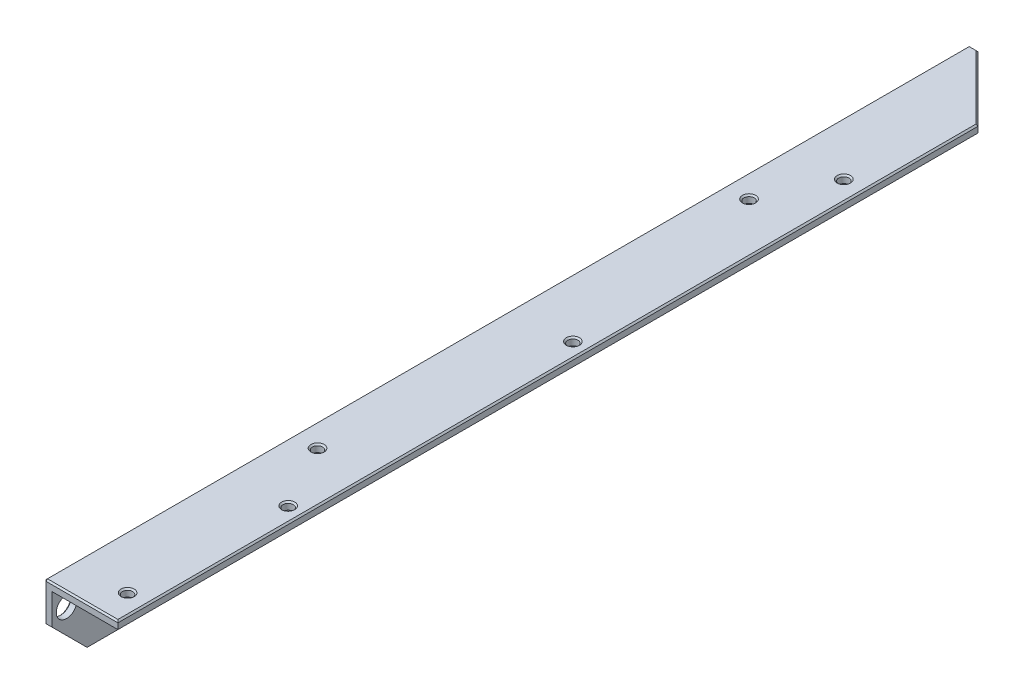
ISO-10303-21;
HEADER;
FILE_DESCRIPTION(('STEP AP214'),'2;1');
FILE_NAME('part.step','',(''),(''),'','','');
FILE_SCHEMA(('AUTOMOTIVE_DESIGN { 1 0 10303 214 1 1 1 1 }'));
ENDSEC;
DATA;
#1=APPLICATION_CONTEXT('core data for automotive mechanical design processes');
#2=APPLICATION_PROTOCOL_DEFINITION('international standard','automotive_design',2000,#1);
#3=PRODUCT_CONTEXT('',#1,'mechanical');
#4=PRODUCT('Part','Part','',(#3));
#5=PRODUCT_RELATED_PRODUCT_CATEGORY('part','',(#4));
#6=PRODUCT_DEFINITION_FORMATION('','',#4);
#7=PRODUCT_DEFINITION_CONTEXT('part definition',#1,'design');
#8=PRODUCT_DEFINITION('design','',#6,#7);
#9=PRODUCT_DEFINITION_SHAPE('','',#8);
#10=(LENGTH_UNIT() NAMED_UNIT(*) SI_UNIT(.MILLI.,.METRE.));
#11=(NAMED_UNIT(*) PLANE_ANGLE_UNIT() SI_UNIT($,.RADIAN.));
#12=(NAMED_UNIT(*) SI_UNIT($,.STERADIAN.) SOLID_ANGLE_UNIT());
#13=UNCERTAINTY_MEASURE_WITH_UNIT(LENGTH_MEASURE(1.E-05),#10,'distance_accuracy_value','');
#14=(GEOMETRIC_REPRESENTATION_CONTEXT(3) GLOBAL_UNCERTAINTY_ASSIGNED_CONTEXT((#13)) GLOBAL_UNIT_ASSIGNED_CONTEXT((#10,
#11,#12)) REPRESENTATION_CONTEXT('',''));
#15=CARTESIAN_POINT('',(0.,0.,0.));
#16=DIRECTION('',(0.,0.,1.));
#17=DIRECTION('',(1.,0.,0.));
#18=AXIS2_PLACEMENT_3D('',#15,#16,#17);
#19=CARTESIAN_POINT('',(2.5,0.,315.));
#20=DIRECTION('',(0.,-1.,0.));
#21=DIRECTION('',(1.,0.,0.));
#22=AXIS2_PLACEMENT_3D('',#19,#20,#21);
#23=PLANE('',#22);
#24=DIRECTION('',(-1.,0.,0.));
#25=VECTOR('',#24,1.);
#26=CARTESIAN_POINT('',(3.,0.,255.));
#27=LINE('',#26,#25);
#28=CARTESIAN_POINT('',(2.5,0.,255.));
#29=VERTEX_POINT('',#28);
#30=CARTESIAN_POINT('',(0.500000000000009,0.,255.));
#31=VERTEX_POINT('',#30);
#32=EDGE_CURVE('E212',#29,#31,#27,.T.);
#33=ORIENTED_EDGE('',*,*,#32,.T.);
#34=DIRECTION('',(0.,0.,-1.));
#35=VECTOR('',#34,1.);
#36=CARTESIAN_POINT('',(0.500000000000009,0.,315.));
#37=LINE('',#36,#35);
#38=CARTESIAN_POINT('',(0.500000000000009,0.,0.));
#39=VERTEX_POINT('',#38);
#40=EDGE_CURVE('E382',#31,#39,#37,.T.);
#41=ORIENTED_EDGE('',*,*,#40,.T.);
#42=DIRECTION('',(-1.,0.,0.));
#43=VECTOR('',#42,1.);
#44=CARTESIAN_POINT('',(2.5,0.,0.));
#45=LINE('',#44,#43);
#46=CARTESIAN_POINT('',(2.5,0.,0.));
#47=VERTEX_POINT('',#46);
#48=EDGE_CURVE('E258',#47,#39,#45,.T.);
#49=ORIENTED_EDGE('',*,*,#48,.F.);
#50=DIRECTION('',(0.,0.,-1.));
#51=VECTOR('',#50,1.);
#52=CARTESIAN_POINT('',(2.5,0.,315.));
#53=LINE('',#52,#51);
#54=EDGE_CURVE('E280',#29,#47,#53,.T.);
#55=ORIENTED_EDGE('',*,*,#54,.F.);
#56=EDGE_LOOP('',(#33,#41,#49,#55));
#57=FACE_BOUND('',#56,.T.);
#58=ADVANCED_FACE('F34',(#57),#23,.T.);
#59=DIRECTION('',(-1.,0.,0.));
#60=VECTOR('',#59,1.);
#61=CARTESIAN_POINT('',(3.,0.,303.));
#62=LINE('',#61,#60);
#63=CARTESIAN_POINT('',(2.5,0.,303.));
#64=VERTEX_POINT('',#63);
#65=CARTESIAN_POINT('',(0.500000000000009,0.,303.));
#66=VERTEX_POINT('',#65);
#67=EDGE_CURVE('E227',#64,#66,#62,.T.);
#68=ORIENTED_EDGE('',*,*,#67,.T.);
#69=DIRECTION('',(0.,0.,-1.));
#70=VECTOR('',#69,1.);
#71=CARTESIAN_POINT('',(0.500000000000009,0.,315.));
#72=LINE('',#71,#70);
#73=CARTESIAN_POINT('',(0.500000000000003,0.,275.));
#74=VERTEX_POINT('',#73);
#75=EDGE_CURVE('E373',#66,#74,#72,.T.);
#76=ORIENTED_EDGE('',*,*,#75,.T.);
#77=DIRECTION('',(-1.,0.,0.));
#78=VECTOR('',#77,1.);
#79=CARTESIAN_POINT('',(3.,0.,275.));
#80=LINE('',#79,#78);
#81=CARTESIAN_POINT('',(2.5,0.,275.));
#82=VERTEX_POINT('',#81);
#83=EDGE_CURVE('E205',#82,#74,#80,.T.);
#84=ORIENTED_EDGE('',*,*,#83,.F.);
#85=EDGE_CURVE('E211',#64,#82,#53,.T.);
#86=ORIENTED_EDGE('',*,*,#85,.F.);
#87=EDGE_LOOP('',(#68,#76,#84,#86));
#88=FACE_BOUND('',#87,.T.);
#89=ADVANCED_FACE('F406',(#88),#23,.T.);
#90=CARTESIAN_POINT('',(2.5,22.5,315.));
#91=DIRECTION('',(1.,0.,0.));
#92=DIRECTION('',(0.,1.,0.));
#93=AXIS2_PLACEMENT_3D('',#90,#91,#92);
#94=PLANE('',#93);
#95=CARTESIAN_POINT('',(2.5,15.5,5.));
#96=DIRECTION('',(1.,0.,0.));
#97=DIRECTION('',(0.,1.,0.));
#98=AXIS2_PLACEMENT_3D('',#95,#96,#97);
#99=CIRCLE('',#98,3.5);
#100=CARTESIAN_POINT('',(2.5,19.,5.));
#101=VERTEX_POINT('',#100);
#102=EDGE_CURVE('E653',#101,#101,#99,.T.);
#103=ORIENTED_EDGE('',*,*,#102,.F.);
#104=EDGE_LOOP('',(#103));
#105=FACE_BOUND('',#104,.T.);
#106=CARTESIAN_POINT('',(2.5,15.5,310.));
#107=DIRECTION('',(1.,0.,0.));
#108=DIRECTION('',(0.,1.,0.));
#109=AXIS2_PLACEMENT_3D('',#106,#107,#108);
#110=CIRCLE('',#109,3.50000000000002);
#111=CARTESIAN_POINT('',(2.5,19.,310.));
#112=VERTEX_POINT('',#111);
#113=EDGE_CURVE('E656',#112,#112,#110,.T.);
#114=ORIENTED_EDGE('',*,*,#113,.F.);
#115=EDGE_LOOP('',(#114));
#116=FACE_BOUND('',#115,.T.);
#117=CARTESIAN_POINT('',(2.5,13.5,257.5));
#118=DIRECTION('',(1.,0.,0.));
#119=DIRECTION('',(0.,1.,0.));
#120=AXIS2_PLACEMENT_3D('',#117,#118,#119);
#121=CIRCLE('',#120,2.5);
#122=CARTESIAN_POINT('',(2.5,16.,257.5));
#123=VERTEX_POINT('',#122);
#124=CARTESIAN_POINT('',(2.5,13.5,255.));
#125=VERTEX_POINT('',#124);
#126=EDGE_CURVE('E219',#123,#125,#121,.F.);
#127=ORIENTED_EDGE('',*,*,#126,.T.);
#128=DIRECTION('',(0.,-1.,0.));
#129=VECTOR('',#128,1.);
#130=CARTESIAN_POINT('',(2.5,22.5,255.));
#131=LINE('',#130,#129);
#132=EDGE_CURVE('E221',#125,#29,#131,.T.);
#133=ORIENTED_EDGE('',*,*,#132,.T.);
#134=ORIENTED_EDGE('',*,*,#54,.T.);
#135=DIRECTION('',(0.,-1.,0.));
#136=VECTOR('',#135,1.);
#137=CARTESIAN_POINT('',(2.5,22.5,0.));
#138=LINE('',#137,#136);
#139=CARTESIAN_POINT('',(2.5,22.5,0.));
#140=VERTEX_POINT('',#139);
#141=EDGE_CURVE('E263',#140,#47,#138,.T.);
#142=ORIENTED_EDGE('',*,*,#141,.F.);
#143=DIRECTION('',(0.,0.,-1.));
#144=VECTOR('',#143,1.);
#145=CARTESIAN_POINT('',(2.5,22.5,315.));
#146=LINE('',#145,#144);
#147=CARTESIAN_POINT('',(2.5,22.5,315.));
#148=VERTEX_POINT('',#147);
#149=EDGE_CURVE('E277',#148,#140,#146,.T.);
#150=ORIENTED_EDGE('',*,*,#149,.F.);
#151=DIRECTION('',(0.,-1.,0.));
#152=VECTOR('',#151,1.);
#153=CARTESIAN_POINT('',(2.5,22.5,315.));
#154=LINE('',#153,#152);
#155=CARTESIAN_POINT('',(2.5,11.9999999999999,315.));
#156=VERTEX_POINT('',#155);
#157=EDGE_CURVE('E271',#148,#156,#154,.T.);
#158=ORIENTED_EDGE('',*,*,#157,.T.);
#159=DIRECTION('',(0.,0.707106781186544,0.707106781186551));
#160=VECTOR('',#159,1.);
#161=CARTESIAN_POINT('',(2.5,17.2499999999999,320.25));
#162=LINE('',#161,#160);
#163=EDGE_CURVE('E230',#64,#156,#162,.T.);
#164=ORIENTED_EDGE('',*,*,#163,.F.);
#165=ORIENTED_EDGE('',*,*,#85,.T.);
#166=DIRECTION('',(0.,1.,0.));
#167=VECTOR('',#166,1.);
#168=CARTESIAN_POINT('',(2.5,22.5,275.));
#169=LINE('',#168,#167);
#170=CARTESIAN_POINT('',(2.5,13.5,275.));
#171=VERTEX_POINT('',#170);
#172=EDGE_CURVE('E197',#82,#171,#169,.T.);
#173=ORIENTED_EDGE('',*,*,#172,.T.);
#174=CARTESIAN_POINT('',(2.5,13.5,272.5));
#175=DIRECTION('',(1.,0.,0.));
#176=DIRECTION('',(0.,1.,0.));
#177=AXIS2_PLACEMENT_3D('',#174,#175,#176);
#178=CIRCLE('',#177,2.5);
#179=CARTESIAN_POINT('',(2.5,16.,272.5));
#180=VERTEX_POINT('',#179);
#181=EDGE_CURVE('E186',#171,#180,#178,.F.);
#182=ORIENTED_EDGE('',*,*,#181,.T.);
#183=DIRECTION('',(0.,0.,-1.));
#184=VECTOR('',#183,1.);
#185=CARTESIAN_POINT('',(2.5,16.,315.));
#186=LINE('',#185,#184);
#187=EDGE_CURVE('E196',#180,#123,#186,.T.);
#188=ORIENTED_EDGE('',*,*,#187,.T.);
#189=EDGE_LOOP('',(#127,#133,#134,#142,#150,#158,#164,#165,#173,#182,#188));
#190=FACE_BOUND('',#189,.T.);
#191=ADVANCED_FACE('F36',(#105,#116,#190),#94,.T.);
#192=CARTESIAN_POINT('',(0.,0.,315.));
#193=DIRECTION('',(-1.,0.,0.));
#194=DIRECTION('',(0.,0.,1.));
#195=AXIS2_PLACEMENT_3D('',#192,#193,#194);
#196=PLANE('',#195);
#197=DIRECTION('',(0.,0.,-1.));
#198=VECTOR('',#197,1.);
#199=CARTESIAN_POINT('',(0.,24.5,315.));
#200=LINE('',#199,#198);
#201=CARTESIAN_POINT('',(0.,24.5,314.5));
#202=VERTEX_POINT('',#201);
#203=CARTESIAN_POINT('',(0.,24.5,0.5));
#204=VERTEX_POINT('',#203);
#205=EDGE_CURVE('E366',#202,#204,#200,.T.);
#206=ORIENTED_EDGE('',*,*,#205,.T.);
#207=DIRECTION('',(0.,-1.,0.));
#208=VECTOR('',#207,1.);
#209=CARTESIAN_POINT('',(0.,0.,0.5));
#210=LINE('',#209,#208);
#211=CARTESIAN_POINT('',(0.,0.500000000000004,0.5));
#212=VERTEX_POINT('',#211);
#213=EDGE_CURVE('E368',#204,#212,#210,.T.);
#214=ORIENTED_EDGE('',*,*,#213,.T.);
#215=DIRECTION('',(0.,0.,1.));
#216=VECTOR('',#215,1.);
#217=CARTESIAN_POINT('',(0.,0.500000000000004,315.));
#218=LINE('',#217,#216);
#219=CARTESIAN_POINT('',(0.,0.500000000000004,254.5));
#220=VERTEX_POINT('',#219);
#221=EDGE_CURVE('E348',#212,#220,#218,.T.);
#222=ORIENTED_EDGE('',*,*,#221,.T.);
#223=DIRECTION('',(0.,1.,0.));
#224=VECTOR('',#223,1.);
#225=CARTESIAN_POINT('',(0.,0.,254.5));
#226=LINE('',#225,#224);
#227=CARTESIAN_POINT('',(0.,13.5,254.5));
#228=VERTEX_POINT('',#227);
#229=EDGE_CURVE('E350',#220,#228,#226,.T.);
#230=ORIENTED_EDGE('',*,*,#229,.T.);
#231=CARTESIAN_POINT('',(0.,13.5,257.5));
#232=DIRECTION('',(-1.,0.,0.));
#233=DIRECTION('',(0.,0.,1.));
#234=AXIS2_PLACEMENT_3D('',#231,#232,#233);
#235=CIRCLE('',#234,3.);
#236=CARTESIAN_POINT('',(0.,16.5,257.5));
#237=VERTEX_POINT('',#236);
#238=EDGE_CURVE('E352',#228,#237,#235,.F.);
#239=ORIENTED_EDGE('',*,*,#238,.T.);
#240=DIRECTION('',(0.,0.,1.));
#241=VECTOR('',#240,1.);
#242=CARTESIAN_POINT('',(0.,16.5,315.));
#243=LINE('',#242,#241);
#244=CARTESIAN_POINT('',(0.,16.5,272.5));
#245=VERTEX_POINT('',#244);
#246=EDGE_CURVE('E354',#237,#245,#243,.T.);
#247=ORIENTED_EDGE('',*,*,#246,.T.);
#248=CARTESIAN_POINT('',(0.,13.5,272.5));
#249=DIRECTION('',(-1.,0.,0.));
#250=DIRECTION('',(0.,0.,1.));
#251=AXIS2_PLACEMENT_3D('',#248,#249,#250);
#252=CIRCLE('',#251,3.);
#253=CARTESIAN_POINT('',(0.,13.5,275.5));
#254=VERTEX_POINT('',#253);
#255=EDGE_CURVE('E356',#245,#254,#252,.F.);
#256=ORIENTED_EDGE('',*,*,#255,.T.);
#257=DIRECTION('',(0.,-1.,0.));
#258=VECTOR('',#257,1.);
#259=CARTESIAN_POINT('',(0.,0.,275.5));
#260=LINE('',#259,#258);
#261=CARTESIAN_POINT('',(0.,0.500000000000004,275.5));
#262=VERTEX_POINT('',#261);
#263=EDGE_CURVE('E358',#254,#262,#260,.T.);
#264=ORIENTED_EDGE('',*,*,#263,.T.);
#265=DIRECTION('',(0.,0.,1.));
#266=VECTOR('',#265,1.);
#267=CARTESIAN_POINT('',(0.,0.500000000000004,315.));
#268=LINE('',#267,#266);
#269=CARTESIAN_POINT('',(0.,0.500000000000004,302.792893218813));
#270=VERTEX_POINT('',#269);
#271=EDGE_CURVE('E360',#262,#270,#268,.T.);
#272=ORIENTED_EDGE('',*,*,#271,.T.);
#273=DIRECTION('',(0.,0.707106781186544,0.707106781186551));
#274=VECTOR('',#273,1.);
#275=CARTESIAN_POINT('',(0.,12.3535533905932,314.646446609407));
#276=LINE('',#275,#274);
#277=CARTESIAN_POINT('',(0.,12.2071067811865,314.5));
#278=VERTEX_POINT('',#277);
#279=EDGE_CURVE('E362',#270,#278,#276,.T.);
#280=ORIENTED_EDGE('',*,*,#279,.T.);
#281=DIRECTION('',(0.,1.,0.));
#282=VECTOR('',#281,1.);
#283=CARTESIAN_POINT('',(0.,25.,314.5));
#284=LINE('',#283,#282);
#285=EDGE_CURVE('E364',#278,#202,#284,.T.);
#286=ORIENTED_EDGE('',*,*,#285,.T.);
#287=EDGE_LOOP('',(#206,#214,#222,#230,#239,#247,#256,#264,#272,#280,#286));
#288=FACE_BOUND('',#287,.T.);
#289=CARTESIAN_POINT('',(0.,15.5,310.));
#290=DIRECTION('',(-1.,0.,0.));
#291=DIRECTION('',(0.,0.,1.));
#292=AXIS2_PLACEMENT_3D('',#289,#290,#291);
#293=CIRCLE('',#292,4.);
#294=CARTESIAN_POINT('',(0.,15.5,314.));
#295=VERTEX_POINT('',#294);
#296=EDGE_CURVE('E345',#295,#295,#293,.F.);
#297=ORIENTED_EDGE('',*,*,#296,.T.);
#298=EDGE_LOOP('',(#297));
#299=FACE_BOUND('',#298,.T.);
#300=CARTESIAN_POINT('',(0.,15.5,5.));
#301=DIRECTION('',(-1.,0.,0.));
#302=DIRECTION('',(0.,0.,1.));
#303=AXIS2_PLACEMENT_3D('',#300,#301,#302);
#304=CIRCLE('',#303,4.);
#305=CARTESIAN_POINT('',(0.,15.5,9.00000000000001));
#306=VERTEX_POINT('',#305);
#307=EDGE_CURVE('E342',#306,#306,#304,.F.);
#308=ORIENTED_EDGE('',*,*,#307,.T.);
#309=EDGE_LOOP('',(#308));
#310=FACE_BOUND('',#309,.T.);
#311=ADVANCED_FACE('F417',(#288,#299,#310),#196,.T.);
#312=CARTESIAN_POINT('',(25.,22.5,315.));
#313=DIRECTION('',(0.,-1.,0.));
#314=DIRECTION('',(1.,0.,0.));
#315=AXIS2_PLACEMENT_3D('',#312,#313,#314);
#316=PLANE('',#315);
#317=DIRECTION('',(-0.707106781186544,0.,-0.707106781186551));
#318=VECTOR('',#317,1.);
#319=CARTESIAN_POINT('',(171.5,22.5,168.500000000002));
#320=LINE('',#319,#318);
#321=CARTESIAN_POINT('',(25.,22.5,22.));
#322=VERTEX_POINT('',#321);
#323=CARTESIAN_POINT('',(3.00000000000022,22.5,0.));
#324=VERTEX_POINT('',#323);
#325=EDGE_CURVE('E238',#322,#324,#320,.T.);
#326=ORIENTED_EDGE('',*,*,#325,.F.);
#327=DIRECTION('',(0.,0.,-1.));
#328=VECTOR('',#327,1.);
#329=CARTESIAN_POINT('',(25.,22.5,315.));
#330=LINE('',#329,#328);
#331=CARTESIAN_POINT('',(25.,22.5,315.));
#332=VERTEX_POINT('',#331);
#333=EDGE_CURVE('E274',#332,#322,#330,.T.);
#334=ORIENTED_EDGE('',*,*,#333,.F.);
#335=DIRECTION('',(-1.,0.,0.));
#336=VECTOR('',#335,1.);
#337=CARTESIAN_POINT('',(25.,22.5,315.));
#338=LINE('',#337,#336);
#339=EDGE_CURVE('E268',#332,#148,#338,.T.);
#340=ORIENTED_EDGE('',*,*,#339,.T.);
#341=ORIENTED_EDGE('',*,*,#149,.T.);
#342=DIRECTION('',(-1.,0.,0.));
#343=VECTOR('',#342,1.);
#344=CARTESIAN_POINT('',(25.,22.5,0.));
#345=LINE('',#344,#343);
#346=EDGE_CURVE('E261',#324,#140,#345,.T.);
#347=ORIENTED_EDGE('',*,*,#346,.F.);
#348=EDGE_LOOP('',(#326,#334,#340,#341,#347));
#349=FACE_BOUND('',#348,.T.);
#350=CARTESIAN_POINT('',(18.3,22.5,305.));
#351=DIRECTION('',(0.,-1.,0.));
#352=DIRECTION('',(1.,0.,0.));
#353=AXIS2_PLACEMENT_3D('',#350,#351,#352);
#354=CIRCLE('',#353,1.75);
#355=CARTESIAN_POINT('',(20.05,22.5,305.));
#356=VERTEX_POINT('',#355);
#357=EDGE_CURVE('E240',#356,#356,#354,.T.);
#358=ORIENTED_EDGE('',*,*,#357,.F.);
#359=EDGE_LOOP('',(#358));
#360=FACE_BOUND('',#359,.T.);
#361=CARTESIAN_POINT('',(20.,22.5,252.));
#362=DIRECTION('',(0.,-1.,0.));
#363=DIRECTION('',(1.,0.,0.));
#364=AXIS2_PLACEMENT_3D('',#361,#362,#363);
#365=CIRCLE('',#364,1.75);
#366=CARTESIAN_POINT('',(21.75,22.5,252.));
#367=VERTEX_POINT('',#366);
#368=EDGE_CURVE('E243',#367,#367,#365,.T.);
#369=ORIENTED_EDGE('',*,*,#368,.F.);
#370=EDGE_LOOP('',(#369));
#371=FACE_BOUND('',#370,.T.);
#372=CARTESIAN_POINT('',(8.,22.5,230.));
#373=DIRECTION('',(0.,-1.,0.));
#374=DIRECTION('',(1.,0.,0.));
#375=AXIS2_PLACEMENT_3D('',#372,#373,#374);
#376=CIRCLE('',#375,1.75);
#377=CARTESIAN_POINT('',(9.75,22.5,230.));
#378=VERTEX_POINT('',#377);
#379=EDGE_CURVE('E246',#378,#378,#376,.T.);
#380=ORIENTED_EDGE('',*,*,#379,.F.);
#381=EDGE_LOOP('',(#380));
#382=FACE_BOUND('',#381,.T.);
#383=CARTESIAN_POINT('',(20.,22.5,155.));
#384=DIRECTION('',(0.,-1.,0.));
#385=DIRECTION('',(1.,0.,0.));
#386=AXIS2_PLACEMENT_3D('',#383,#384,#385);
#387=CIRCLE('',#386,1.75);
#388=CARTESIAN_POINT('',(21.75,22.5,155.));
#389=VERTEX_POINT('',#388);
#390=EDGE_CURVE('E249',#389,#389,#387,.T.);
#391=ORIENTED_EDGE('',*,*,#390,.F.);
#392=EDGE_LOOP('',(#391));
#393=FACE_BOUND('',#392,.T.);
#394=CARTESIAN_POINT('',(8.,22.5,83.));
#395=DIRECTION('',(0.,-1.,0.));
#396=DIRECTION('',(1.,0.,0.));
#397=AXIS2_PLACEMENT_3D('',#394,#395,#396);
#398=CIRCLE('',#397,1.75);
#399=CARTESIAN_POINT('',(9.75,22.5,83.));
#400=VERTEX_POINT('',#399);
#401=EDGE_CURVE('E252',#400,#400,#398,.T.);
#402=ORIENTED_EDGE('',*,*,#401,.F.);
#403=EDGE_LOOP('',(#402));
#404=FACE_BOUND('',#403,.T.);
#405=CARTESIAN_POINT('',(18.3,22.5,61.));
#406=DIRECTION('',(0.,-1.,0.));
#407=DIRECTION('',(1.,0.,0.));
#408=AXIS2_PLACEMENT_3D('',#405,#406,#407);
#409=CIRCLE('',#408,1.75);
#410=CARTESIAN_POINT('',(20.05,22.5,61.));
#411=VERTEX_POINT('',#410);
#412=EDGE_CURVE('E255',#411,#411,#409,.T.);
#413=ORIENTED_EDGE('',*,*,#412,.F.);
#414=EDGE_LOOP('',(#413));
#415=FACE_BOUND('',#414,.T.);
#416=ADVANCED_FACE('F420',(#349,#360,#371,#382,#393,#404,#415),#316,.T.);
#417=CARTESIAN_POINT('',(25.,25.,315.));
#418=DIRECTION('',(1.,0.,0.));
#419=DIRECTION('',(0.,1.,0.));
#420=AXIS2_PLACEMENT_3D('',#417,#418,#419);
#421=PLANE('',#420);
#422=DIRECTION('',(0.,1.,0.));
#423=VECTOR('',#422,1.);
#424=CARTESIAN_POINT('',(25.,22.,22.));
#425=LINE('',#424,#423);
#426=CARTESIAN_POINT('',(25.,24.5,22.));
#427=VERTEX_POINT('',#426);
#428=EDGE_CURVE('E235',#322,#427,#425,.T.);
#429=ORIENTED_EDGE('',*,*,#428,.T.);
#430=DIRECTION('',(0.,0.,1.));
#431=VECTOR('',#430,1.);
#432=CARTESIAN_POINT('',(25.,24.5,315.));
#433=LINE('',#432,#431);
#434=CARTESIAN_POINT('',(25.,24.5,315.));
#435=VERTEX_POINT('',#434);
#436=EDGE_CURVE('E329',#427,#435,#433,.T.);
#437=ORIENTED_EDGE('',*,*,#436,.T.);
#438=DIRECTION('',(0.,-1.,0.));
#439=VECTOR('',#438,1.);
#440=CARTESIAN_POINT('',(25.,25.,315.));
#441=LINE('',#440,#439);
#442=EDGE_CURVE('E266',#435,#332,#441,.T.);
#443=ORIENTED_EDGE('',*,*,#442,.T.);
#444=ORIENTED_EDGE('',*,*,#333,.T.);
#445=EDGE_LOOP('',(#429,#437,#443,#444));
#446=FACE_BOUND('',#445,.T.);
#447=ADVANCED_FACE('F425',(#446),#421,.T.);
#448=CARTESIAN_POINT('',(0.,25.,315.));
#449=DIRECTION('',(0.,1.,0.));
#450=DIRECTION('',(0.,0.,1.));
#451=AXIS2_PLACEMENT_3D('',#448,#449,#450);
#452=PLANE('',#451);
#453=CARTESIAN_POINT('',(18.3,25.,61.));
#454=DIRECTION('',(0.,1.,0.));
#455=DIRECTION('',(0.,0.,1.));
#456=AXIS2_PLACEMENT_3D('',#453,#454,#455);
#457=CIRCLE('',#456,2.25);
#458=CARTESIAN_POINT('',(18.3,25.,63.25));
#459=VERTEX_POINT('',#458);
#460=EDGE_CURVE('E311',#459,#459,#457,.F.);
#461=ORIENTED_EDGE('',*,*,#460,.T.);
#462=EDGE_LOOP('',(#461));
#463=FACE_BOUND('',#462,.T.);
#464=CARTESIAN_POINT('',(8.,25.,83.));
#465=DIRECTION('',(0.,1.,0.));
#466=DIRECTION('',(0.,0.,1.));
#467=AXIS2_PLACEMENT_3D('',#464,#465,#466);
#468=CIRCLE('',#467,2.25);
#469=CARTESIAN_POINT('',(8.,25.,85.25));
#470=VERTEX_POINT('',#469);
#471=EDGE_CURVE('E308',#470,#470,#468,.F.);
#472=ORIENTED_EDGE('',*,*,#471,.T.);
#473=EDGE_LOOP('',(#472));
#474=FACE_BOUND('',#473,.T.);
#475=CARTESIAN_POINT('',(20.,25.,155.));
#476=DIRECTION('',(0.,1.,0.));
#477=DIRECTION('',(0.,0.,1.));
#478=AXIS2_PLACEMENT_3D('',#475,#476,#477);
#479=CIRCLE('',#478,2.25);
#480=CARTESIAN_POINT('',(20.,25.,157.25));
#481=VERTEX_POINT('',#480);
#482=EDGE_CURVE('E305',#481,#481,#479,.F.);
#483=ORIENTED_EDGE('',*,*,#482,.T.);
#484=EDGE_LOOP('',(#483));
#485=FACE_BOUND('',#484,.T.);
#486=CARTESIAN_POINT('',(8.,25.,230.));
#487=DIRECTION('',(0.,1.,0.));
#488=DIRECTION('',(0.,0.,1.));
#489=AXIS2_PLACEMENT_3D('',#486,#487,#488);
#490=CIRCLE('',#489,2.25);
#491=CARTESIAN_POINT('',(8.,25.,232.25));
#492=VERTEX_POINT('',#491);
#493=EDGE_CURVE('E302',#492,#492,#490,.F.);
#494=ORIENTED_EDGE('',*,*,#493,.T.);
#495=EDGE_LOOP('',(#494));
#496=FACE_BOUND('',#495,.T.);
#497=CARTESIAN_POINT('',(20.,25.,252.));
#498=DIRECTION('',(0.,1.,0.));
#499=DIRECTION('',(0.,0.,1.));
#500=AXIS2_PLACEMENT_3D('',#497,#498,#499);
#501=CIRCLE('',#500,2.25000000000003);
#502=CARTESIAN_POINT('',(20.,25.,254.25));
#503=VERTEX_POINT('',#502);
#504=EDGE_CURVE('E299',#503,#503,#501,.F.);
#505=ORIENTED_EDGE('',*,*,#504,.T.);
#506=EDGE_LOOP('',(#505));
#507=FACE_BOUND('',#506,.T.);
#508=CARTESIAN_POINT('',(18.3,25.,305.));
#509=DIRECTION('',(0.,1.,0.));
#510=DIRECTION('',(0.,0.,1.));
#511=AXIS2_PLACEMENT_3D('',#508,#509,#510);
#512=CIRCLE('',#511,2.25000000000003);
#513=CARTESIAN_POINT('',(18.3,25.,307.25));
#514=VERTEX_POINT('',#513);
#515=EDGE_CURVE('E296',#514,#514,#512,.F.);
#516=ORIENTED_EDGE('',*,*,#515,.T.);
#517=EDGE_LOOP('',(#516));
#518=FACE_BOUND('',#517,.T.);
#519=DIRECTION('',(0.,0.,-1.));
#520=VECTOR('',#519,1.);
#521=CARTESIAN_POINT('',(24.5,25.,315.));
#522=LINE('',#521,#520);
#523=CARTESIAN_POINT('',(24.5,25.,314.5));
#524=VERTEX_POINT('',#523);
#525=CARTESIAN_POINT('',(24.5,25.,22.2071067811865));
#526=VERTEX_POINT('',#525);
#527=EDGE_CURVE('E291',#524,#526,#522,.T.);
#528=ORIENTED_EDGE('',*,*,#527,.T.);
#529=DIRECTION('',(-0.707106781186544,0.,-0.707106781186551));
#530=VECTOR('',#529,1.);
#531=CARTESIAN_POINT('',(2.64644660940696,25.,0.353553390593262));
#532=LINE('',#531,#530);
#533=CARTESIAN_POINT('',(2.7928932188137,25.,0.5));
#534=VERTEX_POINT('',#533);
#535=EDGE_CURVE('E294',#526,#534,#532,.T.);
#536=ORIENTED_EDGE('',*,*,#535,.T.);
#537=DIRECTION('',(-1.,0.,0.));
#538=VECTOR('',#537,1.);
#539=CARTESIAN_POINT('',(0.,25.,0.5));
#540=LINE('',#539,#538);
#541=CARTESIAN_POINT('',(0.500000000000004,25.,0.5));
#542=VERTEX_POINT('',#541);
#543=EDGE_CURVE('E287',#534,#542,#540,.T.);
#544=ORIENTED_EDGE('',*,*,#543,.T.);
#545=DIRECTION('',(0.,0.,1.));
#546=VECTOR('',#545,1.);
#547=CARTESIAN_POINT('',(0.500000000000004,25.,315.));
#548=LINE('',#547,#546);
#549=CARTESIAN_POINT('',(0.500000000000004,25.,314.5));
#550=VERTEX_POINT('',#549);
#551=EDGE_CURVE('E285',#542,#550,#548,.T.);
#552=ORIENTED_EDGE('',*,*,#551,.T.);
#553=DIRECTION('',(1.,0.,0.));
#554=VECTOR('',#553,1.);
#555=CARTESIAN_POINT('',(25.,25.,314.5));
#556=LINE('',#555,#554);
#557=EDGE_CURVE('E289',#550,#524,#556,.T.);
#558=ORIENTED_EDGE('',*,*,#557,.T.);
#559=EDGE_LOOP('',(#528,#536,#544,#552,#558));
#560=FACE_BOUND('',#559,.T.);
#561=ADVANCED_FACE('F422',(#463,#474,#485,#496,#507,#518,#560),#452,.T.);
#562=CARTESIAN_POINT('',(0.,0.,315.));
#563=DIRECTION('',(0.,0.,-1.));
#564=DIRECTION('',(-1.,0.,0.));
#565=AXIS2_PLACEMENT_3D('',#562,#563,#564);
#566=PLANE('',#565);
#567=ORIENTED_EDGE('',*,*,#442,.F.);
#568=DIRECTION('',(-1.,0.,0.));
#569=VECTOR('',#568,1.);
#570=CARTESIAN_POINT('',(0.,24.5,315.));
#571=LINE('',#570,#569);
#572=CARTESIAN_POINT('',(0.500000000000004,24.5,315.));
#573=VERTEX_POINT('',#572);
#574=EDGE_CURVE('E334',#435,#573,#571,.T.);
#575=ORIENTED_EDGE('',*,*,#574,.T.);
#576=DIRECTION('',(0.,-1.,0.));
#577=VECTOR('',#576,1.);
#578=CARTESIAN_POINT('',(0.500000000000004,11.9999999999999,315.));
#579=LINE('',#578,#577);
#580=CARTESIAN_POINT('',(0.500000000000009,11.9999999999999,315.));
#581=VERTEX_POINT('',#580);
#582=EDGE_CURVE('E332',#573,#581,#579,.T.);
#583=ORIENTED_EDGE('',*,*,#582,.T.);
#584=DIRECTION('',(-1.,0.,0.));
#585=VECTOR('',#584,1.);
#586=CARTESIAN_POINT('',(3.,11.9999999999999,315.));
#587=LINE('',#586,#585);
#588=EDGE_CURVE('E224',#156,#581,#587,.T.);
#589=ORIENTED_EDGE('',*,*,#588,.F.);
#590=ORIENTED_EDGE('',*,*,#157,.F.);
#591=ORIENTED_EDGE('',*,*,#339,.F.);
#592=EDGE_LOOP('',(#567,#575,#583,#589,#590,#591));
#593=FACE_BOUND('',#592,.T.);
#594=ADVANCED_FACE('F415',(#593),#566,.F.);
#595=CARTESIAN_POINT('',(0.,0.,0.));
#596=DIRECTION('',(0.,0.,-1.));
#597=DIRECTION('',(-1.,0.,0.));
#598=AXIS2_PLACEMENT_3D('',#595,#596,#597);
#599=PLANE('',#598);
#600=DIRECTION('',(0.,1.,0.));
#601=VECTOR('',#600,1.);
#602=CARTESIAN_POINT('',(0.500000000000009,0.,0.));
#603=LINE('',#602,#601);
#604=CARTESIAN_POINT('',(0.500000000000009,24.5,0.));
#605=VERTEX_POINT('',#604);
#606=EDGE_CURVE('E336',#39,#605,#603,.T.);
#607=ORIENTED_EDGE('',*,*,#606,.T.);
#608=DIRECTION('',(1.,0.,0.));
#609=VECTOR('',#608,1.);
#610=CARTESIAN_POINT('',(0.,24.5,0.));
#611=LINE('',#610,#609);
#612=CARTESIAN_POINT('',(3.00000000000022,24.5,0.));
#613=VERTEX_POINT('',#612);
#614=EDGE_CURVE('E338',#605,#613,#611,.T.);
#615=ORIENTED_EDGE('',*,*,#614,.T.);
#616=DIRECTION('',(0.,1.,0.));
#617=VECTOR('',#616,1.);
#618=CARTESIAN_POINT('',(3.00000000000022,22.,0.));
#619=LINE('',#618,#617);
#620=EDGE_CURVE('E232',#324,#613,#619,.T.);
#621=ORIENTED_EDGE('',*,*,#620,.F.);
#622=ORIENTED_EDGE('',*,*,#346,.T.);
#623=ORIENTED_EDGE('',*,*,#141,.T.);
#624=ORIENTED_EDGE('',*,*,#48,.T.);
#625=EDGE_LOOP('',(#607,#615,#621,#622,#623,#624));
#626=FACE_BOUND('',#625,.T.);
#627=ADVANCED_FACE('F452',(#626),#599,.T.);
#628=CARTESIAN_POINT('',(18.3,22.,61.));
#629=DIRECTION('',(0.,1.,0.));
#630=DIRECTION('',(0.,0.,1.));
#631=AXIS2_PLACEMENT_3D('',#628,#629,#630);
#632=CYLINDRICAL_SURFACE('',#631,1.75);
#633=CARTESIAN_POINT('',(18.3,24.5,61.));
#634=DIRECTION('',(0.,1.,0.));
#635=DIRECTION('',(0.,0.,1.));
#636=AXIS2_PLACEMENT_3D('',#633,#634,#635);
#637=CIRCLE('',#636,1.75);
#638=CARTESIAN_POINT('',(18.3,24.5,62.75));
#639=VERTEX_POINT('',#638);
#640=EDGE_CURVE('E282',#639,#639,#637,.T.);
#641=ORIENTED_EDGE('',*,*,#640,.T.);
#642=EDGE_LOOP('',(#641));
#643=FACE_BOUND('',#642,.T.);
#644=ORIENTED_EDGE('',*,*,#412,.T.);
#645=EDGE_LOOP('',(#644));
#646=FACE_BOUND('',#645,.T.);
#647=ADVANCED_FACE('F449',(#643,#646),#632,.F.);
#648=CARTESIAN_POINT('',(8.,22.,83.));
#649=DIRECTION('',(0.,1.,0.));
#650=DIRECTION('',(0.,0.,1.));
#651=AXIS2_PLACEMENT_3D('',#648,#649,#650);
#652=CYLINDRICAL_SURFACE('',#651,1.75);
#653=CARTESIAN_POINT('',(8.,24.5,83.));
#654=DIRECTION('',(0.,1.,0.));
#655=DIRECTION('',(0.,0.,1.));
#656=AXIS2_PLACEMENT_3D('',#653,#654,#655);
#657=CIRCLE('',#656,1.75);
#658=CARTESIAN_POINT('',(8.,24.5,84.75));
#659=VERTEX_POINT('',#658);
#660=EDGE_CURVE('E314',#659,#659,#657,.T.);
#661=ORIENTED_EDGE('',*,*,#660,.T.);
#662=EDGE_LOOP('',(#661));
#663=FACE_BOUND('',#662,.T.);
#664=ORIENTED_EDGE('',*,*,#401,.T.);
#665=EDGE_LOOP('',(#664));
#666=FACE_BOUND('',#665,.T.);
#667=ADVANCED_FACE('F451',(#663,#666),#652,.F.);
#668=CARTESIAN_POINT('',(20.,22.,155.));
#669=DIRECTION('',(0.,1.,0.));
#670=DIRECTION('',(0.,0.,1.));
#671=AXIS2_PLACEMENT_3D('',#668,#669,#670);
#672=CYLINDRICAL_SURFACE('',#671,1.75);
#673=CARTESIAN_POINT('',(20.,24.5,155.));
#674=DIRECTION('',(0.,1.,0.));
#675=DIRECTION('',(0.,0.,1.));
#676=AXIS2_PLACEMENT_3D('',#673,#674,#675);
#677=CIRCLE('',#676,1.75);
#678=CARTESIAN_POINT('',(20.,24.5,156.75));
#679=VERTEX_POINT('',#678);
#680=EDGE_CURVE('E317',#679,#679,#677,.T.);
#681=ORIENTED_EDGE('',*,*,#680,.T.);
#682=EDGE_LOOP('',(#681));
#683=FACE_BOUND('',#682,.T.);
#684=ORIENTED_EDGE('',*,*,#390,.T.);
#685=EDGE_LOOP('',(#684));
#686=FACE_BOUND('',#685,.T.);
#687=ADVANCED_FACE('F459',(#683,#686),#672,.F.);
#688=CARTESIAN_POINT('',(8.,22.,230.));
#689=DIRECTION('',(0.,1.,0.));
#690=DIRECTION('',(0.,0.,1.));
#691=AXIS2_PLACEMENT_3D('',#688,#689,#690);
#692=CYLINDRICAL_SURFACE('',#691,1.75);
#693=CARTESIAN_POINT('',(8.,24.5,230.));
#694=DIRECTION('',(0.,1.,0.));
#695=DIRECTION('',(0.,0.,1.));
#696=AXIS2_PLACEMENT_3D('',#693,#694,#695);
#697=CIRCLE('',#696,1.75);
#698=CARTESIAN_POINT('',(8.,24.5,231.75));
#699=VERTEX_POINT('',#698);
#700=EDGE_CURVE('E320',#699,#699,#697,.T.);
#701=ORIENTED_EDGE('',*,*,#700,.T.);
#702=EDGE_LOOP('',(#701));
#703=FACE_BOUND('',#702,.T.);
#704=ORIENTED_EDGE('',*,*,#379,.T.);
#705=EDGE_LOOP('',(#704));
#706=FACE_BOUND('',#705,.T.);
#707=ADVANCED_FACE('F466',(#703,#706),#692,.F.);
#708=CARTESIAN_POINT('',(20.,22.,252.));
#709=DIRECTION('',(0.,1.,0.));
#710=DIRECTION('',(0.,0.,1.));
#711=AXIS2_PLACEMENT_3D('',#708,#709,#710);
#712=CYLINDRICAL_SURFACE('',#711,1.75);
#713=CARTESIAN_POINT('',(20.,24.5,252.));
#714=DIRECTION('',(0.,1.,0.));
#715=DIRECTION('',(0.,0.,1.));
#716=AXIS2_PLACEMENT_3D('',#713,#714,#715);
#717=CIRCLE('',#716,1.75);
#718=CARTESIAN_POINT('',(20.,24.5,253.75));
#719=VERTEX_POINT('',#718);
#720=EDGE_CURVE('E323',#719,#719,#717,.T.);
#721=ORIENTED_EDGE('',*,*,#720,.T.);
#722=EDGE_LOOP('',(#721));
#723=FACE_BOUND('',#722,.T.);
#724=ORIENTED_EDGE('',*,*,#368,.T.);
#725=EDGE_LOOP('',(#724));
#726=FACE_BOUND('',#725,.T.);
#727=ADVANCED_FACE('F470',(#723,#726),#712,.F.);
#728=CARTESIAN_POINT('',(18.3,22.,305.));
#729=DIRECTION('',(0.,1.,0.));
#730=DIRECTION('',(0.,0.,1.));
#731=AXIS2_PLACEMENT_3D('',#728,#729,#730);
#732=CYLINDRICAL_SURFACE('',#731,1.75);
#733=CARTESIAN_POINT('',(18.3,24.5,305.));
#734=DIRECTION('',(0.,1.,0.));
#735=DIRECTION('',(0.,0.,1.));
#736=AXIS2_PLACEMENT_3D('',#733,#734,#735);
#737=CIRCLE('',#736,1.75);
#738=CARTESIAN_POINT('',(18.3,24.5,306.75));
#739=VERTEX_POINT('',#738);
#740=EDGE_CURVE('E326',#739,#739,#737,.T.);
#741=ORIENTED_EDGE('',*,*,#740,.T.);
#742=EDGE_LOOP('',(#741));
#743=FACE_BOUND('',#742,.T.);
#744=ORIENTED_EDGE('',*,*,#357,.T.);
#745=EDGE_LOOP('',(#744));
#746=FACE_BOUND('',#745,.T.);
#747=ADVANCED_FACE('F474',(#743,#746),#732,.F.);
#748=CARTESIAN_POINT('',(3.00000000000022,22.,0.));
#749=DIRECTION('',(-0.707106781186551,0.,0.707106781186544));
#750=DIRECTION('',(0.707106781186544,0.,0.707106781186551));
#751=AXIS2_PLACEMENT_3D('',#748,#749,#750);
#752=PLANE('',#751);
#753=ORIENTED_EDGE('',*,*,#620,.T.);
#754=DIRECTION('',(0.707106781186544,0.,0.707106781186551));
#755=VECTOR('',#754,1.);
#756=CARTESIAN_POINT('',(25.,24.5,22.));
#757=LINE('',#756,#755);
#758=EDGE_CURVE('E340',#613,#427,#757,.T.);
#759=ORIENTED_EDGE('',*,*,#758,.T.);
#760=ORIENTED_EDGE('',*,*,#428,.F.);
#761=ORIENTED_EDGE('',*,*,#325,.T.);
#762=EDGE_LOOP('',(#753,#759,#760,#761));
#763=FACE_BOUND('',#762,.T.);
#764=ADVANCED_FACE('F478',(#763),#752,.F.);
#765=CARTESIAN_POINT('',(3.,11.9999999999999,315.));
#766=DIRECTION('',(0.,0.707106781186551,-0.707106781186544));
#767=DIRECTION('',(0.,0.707106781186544,0.707106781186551));
#768=AXIS2_PLACEMENT_3D('',#765,#766,#767);
#769=PLANE('',#768);
#770=ORIENTED_EDGE('',*,*,#588,.T.);
#771=DIRECTION('',(0.,-0.707106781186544,-0.707106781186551));
#772=VECTOR('',#771,1.);
#773=CARTESIAN_POINT('',(0.50000000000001,0.,303.));
#774=LINE('',#773,#772);
#775=EDGE_CURVE('E371',#581,#66,#774,.T.);
#776=ORIENTED_EDGE('',*,*,#775,.T.);
#777=ORIENTED_EDGE('',*,*,#67,.F.);
#778=ORIENTED_EDGE('',*,*,#163,.T.);
#779=EDGE_LOOP('',(#770,#776,#777,#778));
#780=FACE_BOUND('',#779,.T.);
#781=ADVANCED_FACE('F482',(#780),#769,.F.);
#782=CARTESIAN_POINT('',(3.,0.,255.));
#783=DIRECTION('',(0.,0.,1.));
#784=DIRECTION('',(1.,0.,0.));
#785=AXIS2_PLACEMENT_3D('',#782,#783,#784);
#786=PLANE('',#785);
#787=DIRECTION('',(-1.,0.,0.));
#788=VECTOR('',#787,1.);
#789=CARTESIAN_POINT('',(3.,13.5,255.));
#790=LINE('',#789,#788);
#791=CARTESIAN_POINT('',(0.500000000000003,13.5,255.));
#792=VERTEX_POINT('',#791);
#793=EDGE_CURVE('E214',#125,#792,#790,.T.);
#794=ORIENTED_EDGE('',*,*,#793,.T.);
#795=DIRECTION('',(0.,-1.,0.));
#796=VECTOR('',#795,1.);
#797=CARTESIAN_POINT('',(0.500000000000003,0.,255.));
#798=LINE('',#797,#796);
#799=EDGE_CURVE('E49',#792,#31,#798,.T.);
#800=ORIENTED_EDGE('',*,*,#799,.T.);
#801=ORIENTED_EDGE('',*,*,#32,.F.);
#802=ORIENTED_EDGE('',*,*,#132,.F.);
#803=EDGE_LOOP('',(#794,#800,#801,#802));
#804=FACE_BOUND('',#803,.T.);
#805=ADVANCED_FACE('F486',(#804),#786,.T.);
#806=CARTESIAN_POINT('',(3.,13.5,257.5));
#807=DIRECTION('',(-1.,0.,0.));
#808=DIRECTION('',(0.,0.,1.));
#809=AXIS2_PLACEMENT_3D('',#806,#807,#808);
#810=CYLINDRICAL_SURFACE('',#809,2.5);
#811=DIRECTION('',(-1.,0.,0.));
#812=VECTOR('',#811,1.);
#813=CARTESIAN_POINT('',(3.,16.,257.5));
#814=LINE('',#813,#812);
#815=CARTESIAN_POINT('',(0.500000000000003,16.,257.5));
#816=VERTEX_POINT('',#815);
#817=EDGE_CURVE('E661',#123,#816,#814,.T.);
#818=ORIENTED_EDGE('',*,*,#817,.T.);
#819=CARTESIAN_POINT('',(0.500000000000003,13.5,257.5));
#820=DIRECTION('',(-1.,0.,0.));
#821=DIRECTION('',(0.,0.,1.));
#822=AXIS2_PLACEMENT_3D('',#819,#820,#821);
#823=CIRCLE('',#822,2.5);
#824=EDGE_CURVE('E57',#816,#792,#823,.T.);
#825=ORIENTED_EDGE('',*,*,#824,.T.);
#826=ORIENTED_EDGE('',*,*,#793,.F.);
#827=ORIENTED_EDGE('',*,*,#126,.F.);
#828=EDGE_LOOP('',(#818,#825,#826,#827));
#829=FACE_BOUND('',#828,.T.);
#830=ADVANCED_FACE('F490',(#829),#810,.F.);
#831=CARTESIAN_POINT('',(3.,16.,257.5));
#832=DIRECTION('',(0.,-1.,0.));
#833=DIRECTION('',(0.,0.,-1.));
#834=AXIS2_PLACEMENT_3D('',#831,#832,#833);
#835=PLANE('',#834);
#836=DIRECTION('',(-1.,0.,0.));
#837=VECTOR('',#836,1.);
#838=CARTESIAN_POINT('',(3.,16.,272.5));
#839=LINE('',#838,#837);
#840=CARTESIAN_POINT('',(0.500000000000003,16.,272.5));
#841=VERTEX_POINT('',#840);
#842=EDGE_CURVE('E192',#180,#841,#839,.T.);
#843=ORIENTED_EDGE('',*,*,#842,.T.);
#844=DIRECTION('',(0.,0.,-1.));
#845=VECTOR('',#844,1.);
#846=CARTESIAN_POINT('',(0.500000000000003,16.,257.5));
#847=LINE('',#846,#845);
#848=EDGE_CURVE('E378',#841,#816,#847,.T.);
#849=ORIENTED_EDGE('',*,*,#848,.T.);
#850=ORIENTED_EDGE('',*,*,#817,.F.);
#851=ORIENTED_EDGE('',*,*,#187,.F.);
#852=EDGE_LOOP('',(#843,#849,#850,#851));
#853=FACE_BOUND('',#852,.T.);
#854=ADVANCED_FACE('F493',(#853),#835,.T.);
#855=CARTESIAN_POINT('',(3.,13.5,272.5));
#856=DIRECTION('',(-1.,0.,0.));
#857=DIRECTION('',(0.,0.,1.));
#858=AXIS2_PLACEMENT_3D('',#855,#856,#857);
#859=CYLINDRICAL_SURFACE('',#858,2.5);
#860=DIRECTION('',(-1.,0.,0.));
#861=VECTOR('',#860,1.);
#862=CARTESIAN_POINT('',(3.,13.5,275.));
#863=LINE('',#862,#861);
#864=CARTESIAN_POINT('',(0.500000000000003,13.5,275.));
#865=VERTEX_POINT('',#864);
#866=EDGE_CURVE('E189',#171,#865,#863,.T.);
#867=ORIENTED_EDGE('',*,*,#866,.T.);
#868=CARTESIAN_POINT('',(0.500000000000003,13.5,272.5));
#869=DIRECTION('',(-1.,0.,0.));
#870=DIRECTION('',(0.,0.,1.));
#871=AXIS2_PLACEMENT_3D('',#868,#869,#870);
#872=CIRCLE('',#871,2.5);
#873=EDGE_CURVE('E376',#865,#841,#872,.T.);
#874=ORIENTED_EDGE('',*,*,#873,.T.);
#875=ORIENTED_EDGE('',*,*,#842,.F.);
#876=ORIENTED_EDGE('',*,*,#181,.F.);
#877=EDGE_LOOP('',(#867,#874,#875,#876));
#878=FACE_BOUND('',#877,.T.);
#879=ADVANCED_FACE('F188',(#878),#859,.F.);
#880=CARTESIAN_POINT('',(3.,13.5,275.));
#881=DIRECTION('',(0.,0.,-1.));
#882=DIRECTION('',(-1.,0.,0.));
#883=AXIS2_PLACEMENT_3D('',#880,#881,#882);
#884=PLANE('',#883);
#885=ORIENTED_EDGE('',*,*,#83,.T.);
#886=DIRECTION('',(0.,1.,0.));
#887=VECTOR('',#886,1.);
#888=CARTESIAN_POINT('',(0.500000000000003,13.5,275.));
#889=LINE('',#888,#887);
#890=EDGE_CURVE('E204',#74,#865,#889,.T.);
#891=ORIENTED_EDGE('',*,*,#890,.T.);
#892=ORIENTED_EDGE('',*,*,#866,.F.);
#893=ORIENTED_EDGE('',*,*,#172,.F.);
#894=EDGE_LOOP('',(#885,#891,#892,#893));
#895=FACE_BOUND('',#894,.T.);
#896=ADVANCED_FACE('F201',(#895),#884,.T.);
#897=CARTESIAN_POINT('',(3.,15.5,310.));
#898=DIRECTION('',(-1.,0.,0.));
#899=DIRECTION('',(0.,0.,1.));
#900=AXIS2_PLACEMENT_3D('',#897,#898,#899);
#901=CYLINDRICAL_SURFACE('',#900,3.50000000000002);
#902=CARTESIAN_POINT('',(0.500000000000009,15.5,310.));
#903=DIRECTION('',(-1.,0.,0.));
#904=DIRECTION('',(0.,0.,1.));
#905=AXIS2_PLACEMENT_3D('',#902,#903,#904);
#906=CIRCLE('',#905,3.50000000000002);
#907=CARTESIAN_POINT('',(0.500000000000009,15.5,313.5));
#908=VERTEX_POINT('',#907);
#909=EDGE_CURVE('E42',#908,#908,#906,.T.);
#910=ORIENTED_EDGE('',*,*,#909,.T.);
#911=EDGE_LOOP('',(#910));
#912=FACE_BOUND('',#911,.T.);
#913=ORIENTED_EDGE('',*,*,#113,.T.);
#914=EDGE_LOOP('',(#913));
#915=FACE_BOUND('',#914,.T.);
#916=ADVANCED_FACE('F386',(#912,#915),#901,.F.);
#917=CARTESIAN_POINT('',(3.,15.5,5.));
#918=DIRECTION('',(-1.,0.,0.));
#919=DIRECTION('',(0.,0.,1.));
#920=AXIS2_PLACEMENT_3D('',#917,#918,#919);
#921=CYLINDRICAL_SURFACE('',#920,3.5);
#922=CARTESIAN_POINT('',(0.500000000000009,15.5,5.));
#923=DIRECTION('',(-1.,0.,0.));
#924=DIRECTION('',(0.,0.,1.));
#925=AXIS2_PLACEMENT_3D('',#922,#923,#924);
#926=CIRCLE('',#925,3.5);
#927=CARTESIAN_POINT('',(0.500000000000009,15.5,8.5));
#928=VERTEX_POINT('',#927);
#929=EDGE_CURVE('E11',#928,#928,#926,.T.);
#930=ORIENTED_EDGE('',*,*,#929,.T.);
#931=EDGE_LOOP('',(#930));
#932=FACE_BOUND('',#931,.T.);
#933=ORIENTED_EDGE('',*,*,#102,.T.);
#934=EDGE_LOOP('',(#933));
#935=FACE_BOUND('',#934,.T.);
#936=ADVANCED_FACE('F503',(#932,#935),#921,.F.);
#937=CARTESIAN_POINT('',(18.3,24.5,61.));
#938=DIRECTION('',(0.,1.,0.));
#939=DIRECTION('',(0.,0.,1.));
#940=AXIS2_PLACEMENT_3D('',#937,#938,#939);
#941=CONICAL_SURFACE('',#940,1.75,0.785398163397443);
#942=ORIENTED_EDGE('',*,*,#460,.F.);
#943=EDGE_LOOP('',(#942));
#944=FACE_BOUND('',#943,.T.);
#945=ORIENTED_EDGE('',*,*,#640,.F.);
#946=EDGE_LOOP('',(#945));
#947=FACE_BOUND('',#946,.T.);
#948=ADVANCED_FACE('F506',(#944,#947),#941,.F.);
#949=CARTESIAN_POINT('',(8.,24.5,83.));
#950=DIRECTION('',(0.,1.,0.));
#951=DIRECTION('',(0.,0.,1.));
#952=AXIS2_PLACEMENT_3D('',#949,#950,#951);
#953=CONICAL_SURFACE('',#952,1.75,0.78539816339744);
#954=ORIENTED_EDGE('',*,*,#471,.F.);
#955=EDGE_LOOP('',(#954));
#956=FACE_BOUND('',#955,.T.);
#957=ORIENTED_EDGE('',*,*,#660,.F.);
#958=EDGE_LOOP('',(#957));
#959=FACE_BOUND('',#958,.T.);
#960=ADVANCED_FACE('F510',(#956,#959),#953,.F.);
#961=CARTESIAN_POINT('',(20.,24.5,155.));
#962=DIRECTION('',(0.,1.,0.));
#963=DIRECTION('',(0.,0.,1.));
#964=AXIS2_PLACEMENT_3D('',#961,#962,#963);
#965=CONICAL_SURFACE('',#964,1.75,0.785398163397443);
#966=ORIENTED_EDGE('',*,*,#482,.F.);
#967=EDGE_LOOP('',(#966));
#968=FACE_BOUND('',#967,.T.);
#969=ORIENTED_EDGE('',*,*,#680,.F.);
#970=EDGE_LOOP('',(#969));
#971=FACE_BOUND('',#970,.T.);
#972=ADVANCED_FACE('F514',(#968,#971),#965,.F.);
#973=CARTESIAN_POINT('',(8.,24.5,230.));
#974=DIRECTION('',(0.,1.,0.));
#975=DIRECTION('',(0.,0.,1.));
#976=AXIS2_PLACEMENT_3D('',#973,#974,#975);
#977=CONICAL_SURFACE('',#976,1.75,0.785398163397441);
#978=ORIENTED_EDGE('',*,*,#493,.F.);
#979=EDGE_LOOP('',(#978));
#980=FACE_BOUND('',#979,.T.);
#981=ORIENTED_EDGE('',*,*,#700,.F.);
#982=EDGE_LOOP('',(#981));
#983=FACE_BOUND('',#982,.T.);
#984=ADVANCED_FACE('F518',(#980,#983),#977,.F.);
#985=CARTESIAN_POINT('',(20.,24.5,252.));
#986=DIRECTION('',(0.,1.,0.));
#987=DIRECTION('',(0.,0.,1.));
#988=AXIS2_PLACEMENT_3D('',#985,#986,#987);
#989=CONICAL_SURFACE('',#988,1.75,0.785398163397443);
#990=ORIENTED_EDGE('',*,*,#504,.F.);
#991=EDGE_LOOP('',(#990));
#992=FACE_BOUND('',#991,.T.);
#993=ORIENTED_EDGE('',*,*,#720,.F.);
#994=EDGE_LOOP('',(#993));
#995=FACE_BOUND('',#994,.T.);
#996=ADVANCED_FACE('F522',(#992,#995),#989,.F.);
#997=CARTESIAN_POINT('',(18.3,24.5,305.));
#998=DIRECTION('',(0.,1.,0.));
#999=DIRECTION('',(0.,0.,1.));
#1000=AXIS2_PLACEMENT_3D('',#997,#998,#999);
#1001=CONICAL_SURFACE('',#1000,1.75,0.78539816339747);
#1002=ORIENTED_EDGE('',*,*,#515,.F.);
#1003=EDGE_LOOP('',(#1002));
#1004=FACE_BOUND('',#1003,.T.);
#1005=ORIENTED_EDGE('',*,*,#740,.F.);
#1006=EDGE_LOOP('',(#1005));
#1007=FACE_BOUND('',#1006,.T.);
#1008=ADVANCED_FACE('F526',(#1004,#1007),#1001,.F.);
#1009=CARTESIAN_POINT('',(0.,16.5,315.));
#1010=DIRECTION('',(0.70710678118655,0.707106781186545,0.));
#1011=DIRECTION('',(-0.707106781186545,0.70710678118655,0.));
#1012=AXIS2_PLACEMENT_3D('',#1009,#1010,#1011);
#1013=PLANE('',#1012);
#1014=DIRECTION('',(-0.707106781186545,0.70710678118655,0.));
#1015=VECTOR('',#1014,1.);
#1016=CARTESIAN_POINT('',(0.500000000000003,16.,257.5));
#1017=LINE('',#1016,#1015);
#1018=EDGE_CURVE('E647',#816,#237,#1017,.T.);
#1019=ORIENTED_EDGE('',*,*,#1018,.F.);
#1020=ORIENTED_EDGE('',*,*,#848,.F.);
#1021=DIRECTION('',(0.707106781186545,-0.70710678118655,0.));
#1022=VECTOR('',#1021,1.);
#1023=CARTESIAN_POINT('',(0.,16.5,272.5));
#1024=LINE('',#1023,#1022);
#1025=EDGE_CURVE('E650',#245,#841,#1024,.T.);
#1026=ORIENTED_EDGE('',*,*,#1025,.F.);
#1027=ORIENTED_EDGE('',*,*,#246,.F.);
#1028=EDGE_LOOP('',(#1019,#1020,#1026,#1027));
#1029=FACE_BOUND('',#1028,.T.);
#1030=ADVANCED_FACE('F530',(#1029),#1013,.F.);
#1031=CARTESIAN_POINT('',(0.,13.5,272.5));
#1032=DIRECTION('',(-1.,0.,0.));
#1033=DIRECTION('',(0.,0.,1.));
#1034=AXIS2_PLACEMENT_3D('',#1031,#1032,#1033);
#1035=CONICAL_SURFACE('',#1034,3.00000000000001,0.785398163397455);
#1036=ORIENTED_EDGE('',*,*,#1025,.T.);
#1037=ORIENTED_EDGE('',*,*,#873,.F.);
#1038=DIRECTION('',(0.70710678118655,0.,-0.707106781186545));
#1039=VECTOR('',#1038,1.);
#1040=CARTESIAN_POINT('',(0.,13.5,275.5));
#1041=LINE('',#1040,#1039);
#1042=EDGE_CURVE('E644',#254,#865,#1041,.T.);
#1043=ORIENTED_EDGE('',*,*,#1042,.F.);
#1044=ORIENTED_EDGE('',*,*,#255,.F.);
#1045=EDGE_LOOP('',(#1036,#1037,#1043,#1044));
#1046=FACE_BOUND('',#1045,.T.);
#1047=ADVANCED_FACE('F534',(#1046),#1035,.F.);
#1048=CARTESIAN_POINT('',(0.,13.5,257.5));
#1049=DIRECTION('',(-1.,0.,0.));
#1050=DIRECTION('',(0.,0.,1.));
#1051=AXIS2_PLACEMENT_3D('',#1048,#1049,#1050);
#1052=CONICAL_SURFACE('',#1051,3.,0.785398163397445);
#1053=ORIENTED_EDGE('',*,*,#1018,.T.);
#1054=ORIENTED_EDGE('',*,*,#238,.F.);
#1055=DIRECTION('',(-0.70710678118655,0.,-0.707106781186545));
#1056=VECTOR('',#1055,1.);
#1057=CARTESIAN_POINT('',(0.500000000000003,13.5,255.));
#1058=LINE('',#1057,#1056);
#1059=EDGE_CURVE('E641',#792,#228,#1058,.T.);
#1060=ORIENTED_EDGE('',*,*,#1059,.F.);
#1061=ORIENTED_EDGE('',*,*,#824,.F.);
#1062=EDGE_LOOP('',(#1053,#1054,#1060,#1061));
#1063=FACE_BOUND('',#1062,.T.);
#1064=ADVANCED_FACE('F538',(#1063),#1052,.F.);
#1065=CARTESIAN_POINT('',(0.,0.,275.5));
#1066=DIRECTION('',(0.707106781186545,0.,0.70710678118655));
#1067=DIRECTION('',(0.70710678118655,0.,-0.707106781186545));
#1068=AXIS2_PLACEMENT_3D('',#1065,#1066,#1067);
#1069=PLANE('',#1068);
#1070=ORIENTED_EDGE('',*,*,#1042,.T.);
#1071=ORIENTED_EDGE('',*,*,#890,.F.);
#1072=DIRECTION('',(-0.577350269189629,0.577350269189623,0.577350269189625));
#1073=VECTOR('',#1072,1.);
#1074=CARTESIAN_POINT('',(0.166666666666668,0.333333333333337,275.333333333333));
#1075=LINE('',#1074,#1073);
#1076=EDGE_CURVE('E638',#262,#74,#1075,.F.);
#1077=ORIENTED_EDGE('',*,*,#1076,.F.);
#1078=ORIENTED_EDGE('',*,*,#263,.F.);
#1079=EDGE_LOOP('',(#1070,#1071,#1077,#1078));
#1080=FACE_BOUND('',#1079,.T.);
#1081=ADVANCED_FACE('F542',(#1080),#1069,.F.);
#1082=CARTESIAN_POINT('',(0.,0.,254.5));
#1083=DIRECTION('',(0.707106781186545,0.,-0.70710678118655));
#1084=DIRECTION('',(-0.70710678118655,0.,-0.707106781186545));
#1085=AXIS2_PLACEMENT_3D('',#1082,#1083,#1084);
#1086=PLANE('',#1085);
#1087=ORIENTED_EDGE('',*,*,#1059,.T.);
#1088=ORIENTED_EDGE('',*,*,#229,.F.);
#1089=DIRECTION('',(-0.577350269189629,0.577350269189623,-0.577350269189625));
#1090=VECTOR('',#1089,1.);
#1091=CARTESIAN_POINT('',(20.5000000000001,-19.9999999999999,275.));
#1092=LINE('',#1091,#1090);
#1093=EDGE_CURVE('E635',#31,#220,#1092,.T.);
#1094=ORIENTED_EDGE('',*,*,#1093,.F.);
#1095=ORIENTED_EDGE('',*,*,#799,.F.);
#1096=EDGE_LOOP('',(#1087,#1088,#1094,#1095));
#1097=FACE_BOUND('',#1096,.T.);
#1098=ADVANCED_FACE('F546',(#1097),#1086,.F.);
#1099=CARTESIAN_POINT('',(0.500000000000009,0.,315.));
#1100=DIRECTION('',(0.707106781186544,0.707106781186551,0.));
#1101=DIRECTION('',(-0.707106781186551,0.707106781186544,0.));
#1102=AXIS2_PLACEMENT_3D('',#1099,#1100,#1101);
#1103=PLANE('',#1102);
#1104=ORIENTED_EDGE('',*,*,#1076,.T.);
#1105=ORIENTED_EDGE('',*,*,#75,.F.);
#1106=DIRECTION('',(0.678598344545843,-0.678598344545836,0.281084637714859));
#1107=VECTOR('',#1106,1.);
#1108=CARTESIAN_POINT('',(2.78892283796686,-2.28892283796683,303.948102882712));
#1109=LINE('',#1108,#1107);
#1110=EDGE_CURVE('E632',#270,#66,#1109,.T.);
#1111=ORIENTED_EDGE('',*,*,#1110,.F.);
#1112=ORIENTED_EDGE('',*,*,#271,.F.);
#1113=EDGE_LOOP('',(#1104,#1105,#1111,#1112));
#1114=FACE_BOUND('',#1113,.T.);
#1115=ADVANCED_FACE('F550',(#1114),#1103,.F.);
#1116=CARTESIAN_POINT('',(0.500000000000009,0.,315.));
#1117=DIRECTION('',(0.707106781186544,0.707106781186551,0.));
#1118=DIRECTION('',(-0.707106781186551,0.707106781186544,0.));
#1119=AXIS2_PLACEMENT_3D('',#1116,#1117,#1118);
#1120=PLANE('',#1119);
#1121=ORIENTED_EDGE('',*,*,#1093,.T.);
#1122=ORIENTED_EDGE('',*,*,#221,.F.);
#1123=DIRECTION('',(0.577350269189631,-0.577350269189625,-0.577350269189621));
#1124=VECTOR('',#1123,1.);
#1125=CARTESIAN_POINT('',(-104.5,104.999999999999,104.999999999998));
#1126=LINE('',#1125,#1124);
#1127=EDGE_CURVE('E630',#39,#212,#1126,.F.);
#1128=ORIENTED_EDGE('',*,*,#1127,.F.);
#1129=ORIENTED_EDGE('',*,*,#40,.F.);
#1130=EDGE_LOOP('',(#1121,#1122,#1128,#1129));
#1131=FACE_BOUND('',#1130,.T.);
#1132=ADVANCED_FACE('F554',(#1131),#1120,.F.);
#1133=CARTESIAN_POINT('',(0.500000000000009,11.9999999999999,315.));
#1134=DIRECTION('',(-0.707106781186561,-0.499999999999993,0.499999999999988));
#1135=DIRECTION('',(0.577350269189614,-0.816496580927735,0.));
#1136=AXIS2_PLACEMENT_3D('',#1133,#1134,#1135);
#1137=PLANE('',#1136);
#1138=ORIENTED_EDGE('',*,*,#1110,.T.);
#1139=ORIENTED_EDGE('',*,*,#775,.F.);
#1140=DIRECTION('',(-0.678598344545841,0.28108463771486,-0.678598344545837));
#1141=VECTOR('',#1140,1.);
#1142=CARTESIAN_POINT('',(0.500000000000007,11.9999999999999,315.));
#1143=LINE('',#1142,#1141);
#1144=EDGE_CURVE('E627',#278,#581,#1143,.F.);
#1145=ORIENTED_EDGE('',*,*,#1144,.F.);
#1146=ORIENTED_EDGE('',*,*,#279,.F.);
#1147=EDGE_LOOP('',(#1138,#1139,#1145,#1146));
#1148=FACE_BOUND('',#1147,.T.);
#1149=ADVANCED_FACE('F558',(#1148),#1137,.T.);
#1150=CARTESIAN_POINT('',(0.500000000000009,0.,0.));
#1151=DIRECTION('',(0.707106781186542,0.,0.707106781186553));
#1152=DIRECTION('',(0.707106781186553,0.,-0.707106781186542));
#1153=AXIS2_PLACEMENT_3D('',#1150,#1151,#1152);
#1154=PLANE('',#1153);
#1155=ORIENTED_EDGE('',*,*,#1127,.T.);
#1156=ORIENTED_EDGE('',*,*,#213,.F.);
#1157=DIRECTION('',(0.707106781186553,0.,-0.707106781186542));
#1158=VECTOR('',#1157,1.);
#1159=CARTESIAN_POINT('',(0.250000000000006,24.5,0.249999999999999));
#1160=LINE('',#1159,#1158);
#1161=EDGE_CURVE('E621',#605,#204,#1160,.F.);
#1162=ORIENTED_EDGE('',*,*,#1161,.F.);
#1163=ORIENTED_EDGE('',*,*,#606,.F.);
#1164=EDGE_LOOP('',(#1155,#1156,#1162,#1163));
#1165=FACE_BOUND('',#1164,.T.);
#1166=ADVANCED_FACE('F562',(#1165),#1154,.F.);
#1167=CARTESIAN_POINT('',(0.,0.,314.5));
#1168=DIRECTION('',(-0.707106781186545,0.,0.70710678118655));
#1169=DIRECTION('',(0.70710678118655,0.,0.707106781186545));
#1170=AXIS2_PLACEMENT_3D('',#1167,#1168,#1169);
#1171=PLANE('',#1170);
#1172=ORIENTED_EDGE('',*,*,#1144,.T.);
#1173=ORIENTED_EDGE('',*,*,#582,.F.);
#1174=DIRECTION('',(0.70710678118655,0.,0.707106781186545));
#1175=VECTOR('',#1174,1.);
#1176=CARTESIAN_POINT('',(0.500000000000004,24.5,315.));
#1177=LINE('',#1176,#1175);
#1178=EDGE_CURVE('E618',#202,#573,#1177,.T.);
#1179=ORIENTED_EDGE('',*,*,#1178,.F.);
#1180=ORIENTED_EDGE('',*,*,#285,.F.);
#1181=EDGE_LOOP('',(#1172,#1173,#1179,#1180));
#1182=FACE_BOUND('',#1181,.T.);
#1183=ADVANCED_FACE('F566',(#1182),#1171,.T.);
#1184=CARTESIAN_POINT('',(0.,24.5,315.));
#1185=DIRECTION('',(0.70710678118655,-0.707106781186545,0.));
#1186=DIRECTION('',(0.707106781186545,0.70710678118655,0.));
#1187=AXIS2_PLACEMENT_3D('',#1184,#1185,#1186);
#1188=PLANE('',#1187);
#1189=DIRECTION('',(-0.707106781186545,-0.70710678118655,0.));
#1190=VECTOR('',#1189,1.);
#1191=CARTESIAN_POINT('',(0.500000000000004,25.,0.5));
#1192=LINE('',#1191,#1190);
#1193=EDGE_CURVE('E624',#204,#542,#1192,.F.);
#1194=ORIENTED_EDGE('',*,*,#1193,.F.);
#1195=ORIENTED_EDGE('',*,*,#205,.F.);
#1196=DIRECTION('',(0.707106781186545,0.70710678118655,0.));
#1197=VECTOR('',#1196,1.);
#1198=CARTESIAN_POINT('',(0.250000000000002,24.75,314.5));
#1199=LINE('',#1198,#1197);
#1200=EDGE_CURVE('E615',#550,#202,#1199,.F.);
#1201=ORIENTED_EDGE('',*,*,#1200,.F.);
#1202=ORIENTED_EDGE('',*,*,#551,.F.);
#1203=EDGE_LOOP('',(#1194,#1195,#1201,#1202));
#1204=FACE_BOUND('',#1203,.T.);
#1205=ADVANCED_FACE('F570',(#1204),#1188,.F.);
#1206=CARTESIAN_POINT('',(0.500000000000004,25.,0.5));
#1207=DIRECTION('',(-0.577350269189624,0.57735026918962,-0.577350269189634));
#1208=DIRECTION('',(-0.707106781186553,0.,0.707106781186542));
#1209=AXIS2_PLACEMENT_3D('',#1206,#1207,#1208);
#1210=PLANE('',#1209);
#1211=ORIENTED_EDGE('',*,*,#1161,.T.);
#1212=ORIENTED_EDGE('',*,*,#1193,.T.);
#1213=DIRECTION('',(0.,0.707106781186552,0.707106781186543));
#1214=VECTOR('',#1213,1.);
#1215=CARTESIAN_POINT('',(0.500000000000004,25.,0.5));
#1216=LINE('',#1215,#1214);
#1217=EDGE_CURVE('E607',#605,#542,#1216,.T.);
#1218=ORIENTED_EDGE('',*,*,#1217,.F.);
#1219=EDGE_LOOP('',(#1211,#1212,#1218));
#1220=FACE_BOUND('',#1219,.T.);
#1221=ADVANCED_FACE('F574',(#1220),#1210,.T.);
#1222=CARTESIAN_POINT('',(0.500000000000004,24.5,315.));
#1223=DIRECTION('',(-0.577350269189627,0.577350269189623,0.577350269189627));
#1224=DIRECTION('',(0.707106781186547,0.,0.707106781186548));
#1225=AXIS2_PLACEMENT_3D('',#1222,#1223,#1224);
#1226=PLANE('',#1225);
#1227=ORIENTED_EDGE('',*,*,#1200,.T.);
#1228=ORIENTED_EDGE('',*,*,#1178,.T.);
#1229=DIRECTION('',(0.,0.70710678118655,-0.707106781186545));
#1230=VECTOR('',#1229,1.);
#1231=CARTESIAN_POINT('',(0.500000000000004,24.5,315.));
#1232=LINE('',#1231,#1230);
#1233=EDGE_CURVE('E603',#550,#573,#1232,.F.);
#1234=ORIENTED_EDGE('',*,*,#1233,.F.);
#1235=EDGE_LOOP('',(#1227,#1228,#1234));
#1236=FACE_BOUND('',#1235,.T.);
#1237=ADVANCED_FACE('F578',(#1236),#1226,.T.);
#1238=CARTESIAN_POINT('',(0.,24.5,0.));
#1239=DIRECTION('',(0.,-0.707106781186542,0.707106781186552));
#1240=DIRECTION('',(0.,-0.707106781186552,-0.707106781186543));
#1241=AXIS2_PLACEMENT_3D('',#1238,#1239,#1240);
#1242=PLANE('',#1241);
#1243=ORIENTED_EDGE('',*,*,#1217,.T.);
#1244=ORIENTED_EDGE('',*,*,#543,.F.);
#1245=DIRECTION('',(0.281084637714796,-0.678598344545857,-0.678598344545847));
#1246=VECTOR('',#1245,1.);
#1247=CARTESIAN_POINT('',(3.00000000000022,24.5,0.));
#1248=LINE('',#1247,#1246);
#1249=EDGE_CURVE('E599',#613,#534,#1248,.F.);
#1250=ORIENTED_EDGE('',*,*,#1249,.F.);
#1251=ORIENTED_EDGE('',*,*,#614,.F.);
#1252=EDGE_LOOP('',(#1243,#1244,#1250,#1251));
#1253=FACE_BOUND('',#1252,.T.);
#1254=ADVANCED_FACE('F582',(#1253),#1242,.F.);
#1255=CARTESIAN_POINT('',(0.,25.,314.5));
#1256=DIRECTION('',(0.,0.707106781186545,0.70710678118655));
#1257=DIRECTION('',(0.,-0.70710678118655,0.707106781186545));
#1258=AXIS2_PLACEMENT_3D('',#1255,#1256,#1257);
#1259=PLANE('',#1258);
#1260=ORIENTED_EDGE('',*,*,#1233,.T.);
#1261=ORIENTED_EDGE('',*,*,#574,.F.);
#1262=DIRECTION('',(0.57735026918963,-0.577350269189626,0.577350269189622));
#1263=VECTOR('',#1262,1.);
#1264=CARTESIAN_POINT('',(16.3333333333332,33.1666666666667,306.333333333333));
#1265=LINE('',#1264,#1263);
#1266=EDGE_CURVE('E604',#524,#435,#1265,.T.);
#1267=ORIENTED_EDGE('',*,*,#1266,.F.);
#1268=ORIENTED_EDGE('',*,*,#557,.F.);
#1269=EDGE_LOOP('',(#1260,#1261,#1267,#1268));
#1270=FACE_BOUND('',#1269,.T.);
#1271=ADVANCED_FACE('F586',(#1270),#1259,.T.);
#1272=CARTESIAN_POINT('',(3.00000000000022,24.5,0.));
#1273=DIRECTION('',(0.500000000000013,0.707106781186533,-0.500000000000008));
#1274=DIRECTION('',(-0.816496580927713,0.577350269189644,0.));
#1275=AXIS2_PLACEMENT_3D('',#1272,#1273,#1274);
#1276=PLANE('',#1275);
#1277=ORIENTED_EDGE('',*,*,#1249,.T.);
#1278=ORIENTED_EDGE('',*,*,#535,.F.);
#1279=DIRECTION('',(-0.678598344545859,0.678598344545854,0.281084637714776));
#1280=VECTOR('',#1279,1.);
#1281=CARTESIAN_POINT('',(19.0654528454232,30.4345471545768,24.458169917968));
#1282=LINE('',#1281,#1280);
#1283=EDGE_CURVE('E609',#427,#526,#1282,.T.);
#1284=ORIENTED_EDGE('',*,*,#1283,.F.);
#1285=ORIENTED_EDGE('',*,*,#758,.F.);
#1286=EDGE_LOOP('',(#1277,#1278,#1284,#1285));
#1287=FACE_BOUND('',#1286,.T.);
#1288=ADVANCED_FACE('F401',(#1287),#1276,.T.);
#1289=CARTESIAN_POINT('',(24.5,25.,315.));
#1290=DIRECTION('',(-0.707106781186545,-0.70710678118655,0.));
#1291=DIRECTION('',(0.70710678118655,-0.707106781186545,0.));
#1292=AXIS2_PLACEMENT_3D('',#1289,#1290,#1291);
#1293=PLANE('',#1292);
#1294=ORIENTED_EDGE('',*,*,#1266,.T.);
#1295=ORIENTED_EDGE('',*,*,#436,.F.);
#1296=ORIENTED_EDGE('',*,*,#1283,.T.);
#1297=ORIENTED_EDGE('',*,*,#527,.F.);
#1298=EDGE_LOOP('',(#1294,#1295,#1296,#1297));
#1299=FACE_BOUND('',#1298,.T.);
#1300=ADVANCED_FACE('F392',(#1299),#1293,.F.);
#1301=CARTESIAN_POINT('',(0.500000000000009,15.5,310.));
#1302=DIRECTION('',(-1.,0.,0.));
#1303=DIRECTION('',(0.,0.,1.));
#1304=AXIS2_PLACEMENT_3D('',#1301,#1302,#1303);
#1305=CONICAL_SURFACE('',#1304,3.50000000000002,0.785398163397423);
#1306=ORIENTED_EDGE('',*,*,#296,.F.);
#1307=EDGE_LOOP('',(#1306));
#1308=FACE_BOUND('',#1307,.T.);
#1309=ORIENTED_EDGE('',*,*,#909,.F.);
#1310=EDGE_LOOP('',(#1309));
#1311=FACE_BOUND('',#1310,.T.);
#1312=ADVANCED_FACE('F389',(#1308,#1311),#1305,.F.);
#1313=CARTESIAN_POINT('',(0.500000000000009,15.5,5.));
#1314=DIRECTION('',(-1.,0.,0.));
#1315=DIRECTION('',(0.,0.,1.));
#1316=AXIS2_PLACEMENT_3D('',#1313,#1314,#1315);
#1317=CONICAL_SURFACE('',#1316,3.5,0.785398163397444);
#1318=ORIENTED_EDGE('',*,*,#307,.F.);
#1319=EDGE_LOOP('',(#1318));
#1320=FACE_BOUND('',#1319,.T.);
#1321=ORIENTED_EDGE('',*,*,#929,.F.);
#1322=EDGE_LOOP('',(#1321));
#1323=FACE_BOUND('',#1322,.T.);
#1324=ADVANCED_FACE('F391',(#1320,#1323),#1317,.F.);
#1325=CLOSED_SHELL('',(#58,#89,#191,#311,#416,#447,#561,#594,#627,#647,#667,#687,#707,#727,#747,
#764,#781,#805,#830,#854,#879,#896,#916,#936,#948,#960,#972,#984,#996,#1008,#1030,#1047,#1064,
#1081,#1098,#1115,#1132,#1149,#1166,#1183,#1205,#1221,#1237,#1254,#1271,#1288,#1300,#1312,#1324));
#1326=MANIFOLD_SOLID_BREP('B2',#1325);
#1327=ADVANCED_BREP_SHAPE_REPRESENTATION('',(#18,#1326),#14);
#1328=SHAPE_DEFINITION_REPRESENTATION(#9,#1327);
ENDSEC;
END-ISO-10303-21;
